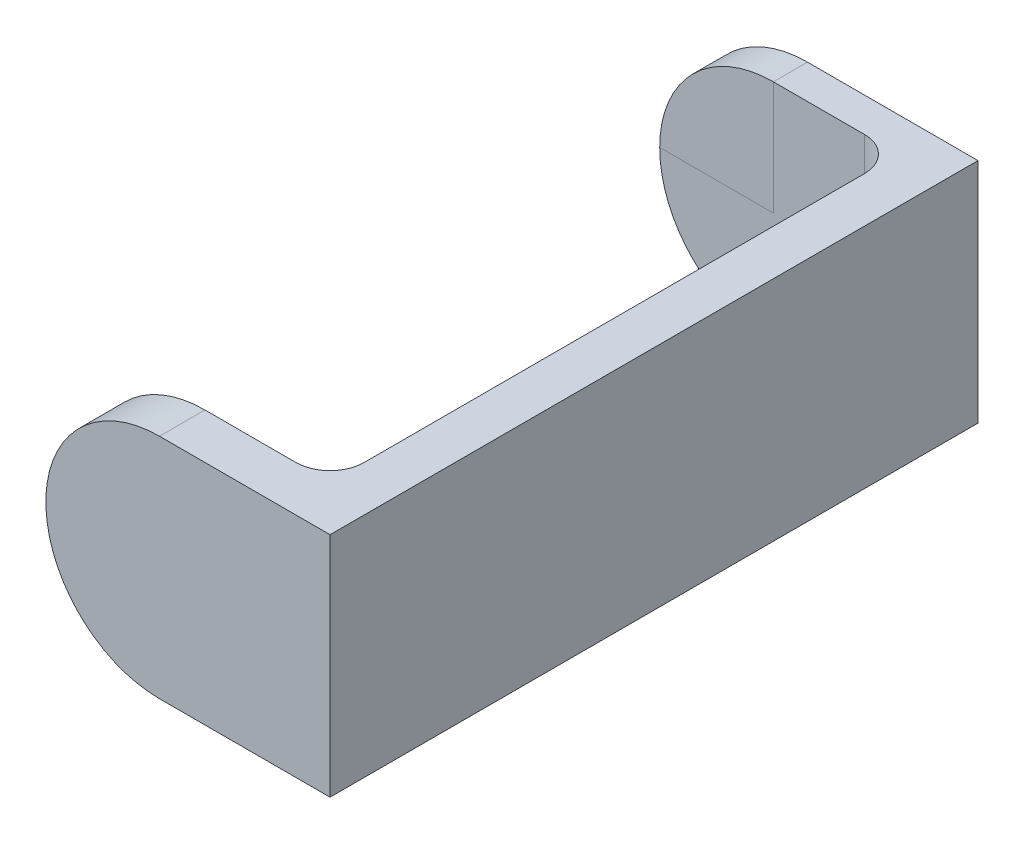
ISO-10303-21;
HEADER;
FILE_DESCRIPTION(('STEP AP214'),'2;1');
FILE_NAME('part.step','',(''),(''),'','','');
FILE_SCHEMA(('AUTOMOTIVE_DESIGN { 1 0 10303 214 1 1 1 1 }'));
ENDSEC;
DATA;
#1=APPLICATION_CONTEXT('core data for automotive mechanical design processes');
#2=APPLICATION_PROTOCOL_DEFINITION('international standard','automotive_design',2000,#1);
#3=PRODUCT_CONTEXT('',#1,'mechanical');
#4=PRODUCT('Part','Part','',(#3));
#5=PRODUCT_RELATED_PRODUCT_CATEGORY('part','',(#4));
#6=PRODUCT_DEFINITION_FORMATION('','',#4);
#7=PRODUCT_DEFINITION_CONTEXT('part definition',#1,'design');
#8=PRODUCT_DEFINITION('design','',#6,#7);
#9=PRODUCT_DEFINITION_SHAPE('','',#8);
#10=(LENGTH_UNIT() NAMED_UNIT(*) SI_UNIT(.MILLI.,.METRE.));
#11=(NAMED_UNIT(*) PLANE_ANGLE_UNIT() SI_UNIT($,.RADIAN.));
#12=(NAMED_UNIT(*) SI_UNIT($,.STERADIAN.) SOLID_ANGLE_UNIT());
#13=UNCERTAINTY_MEASURE_WITH_UNIT(LENGTH_MEASURE(1.E-05),#10,'distance_accuracy_value','');
#14=(GEOMETRIC_REPRESENTATION_CONTEXT(3) GLOBAL_UNCERTAINTY_ASSIGNED_CONTEXT((#13)) GLOBAL_UNIT_ASSIGNED_CONTEXT((#10,
#11,#12)) REPRESENTATION_CONTEXT('',''));
#15=CARTESIAN_POINT('',(0.,0.,0.));
#16=DIRECTION('',(0.,0.,1.));
#17=DIRECTION('',(1.,0.,0.));
#18=AXIS2_PLACEMENT_3D('',#15,#16,#17);
#19=CARTESIAN_POINT('',(0.,0.,500.));
#20=DIRECTION('',(0.,0.,1.));
#21=DIRECTION('',(1.,0.,0.));
#22=AXIS2_PLACEMENT_3D('',#19,#20,#21);
#23=PLANE('',#22);
#24=DIRECTION('',(-1.,0.,0.));
#25=VECTOR('',#24,1.);
#26=CARTESIAN_POINT('',(0.,200.,500.));
#27=LINE('',#26,#25);
#28=CARTESIAN_POINT('',(160.,200.,500.));
#29=VERTEX_POINT('',#28);
#30=CARTESIAN_POINT('',(0.,200.,500.));
#31=VERTEX_POINT('',#30);
#32=EDGE_CURVE('E171',#29,#31,#27,.T.);
#33=ORIENTED_EDGE('',*,*,#32,.F.);
#34=DIRECTION('',(0.,-1.,0.));
#35=VECTOR('',#34,1.);
#36=CARTESIAN_POINT('',(160.,-200.,500.));
#37=LINE('',#36,#35);
#38=CARTESIAN_POINT('',(160.,-200.,500.));
#39=VERTEX_POINT('',#38);
#40=EDGE_CURVE('E206',#29,#39,#37,.T.);
#41=ORIENTED_EDGE('',*,*,#40,.T.);
#42=DIRECTION('',(1.,0.,0.));
#43=VECTOR('',#42,1.);
#44=CARTESIAN_POINT('',(0.,-200.,500.));
#45=LINE('',#44,#43);
#46=CARTESIAN_POINT('',(0.,-200.,500.));
#47=VERTEX_POINT('',#46);
#48=EDGE_CURVE('E181',#47,#39,#45,.T.);
#49=ORIENTED_EDGE('',*,*,#48,.F.);
#50=CARTESIAN_POINT('',(0.,0.,500.));
#51=DIRECTION('',(0.,0.,1.));
#52=DIRECTION('',(1.,0.,0.));
#53=AXIS2_PLACEMENT_3D('',#50,#51,#52);
#54=CIRCLE('',#53,200.);
#55=CARTESIAN_POINT('',(-200.,0.,500.));
#56=VERTEX_POINT('',#55);
#57=EDGE_CURVE('E182',#56,#47,#54,.T.);
#58=ORIENTED_EDGE('',*,*,#57,.F.);
#59=DIRECTION('',(-1.,0.,0.));
#60=VECTOR('',#59,1.);
#61=CARTESIAN_POINT('',(0.,0.,500.));
#62=LINE('',#61,#60);
#63=CARTESIAN_POINT('',(0.,0.,500.));
#64=VERTEX_POINT('',#63);
#65=EDGE_CURVE('E232',#64,#56,#62,.T.);
#66=ORIENTED_EDGE('',*,*,#65,.F.);
#67=DIRECTION('',(0.,-1.,0.));
#68=VECTOR('',#67,1.);
#69=CARTESIAN_POINT('',(0.,0.,500.));
#70=LINE('',#69,#68);
#71=EDGE_CURVE('E227',#31,#64,#70,.T.);
#72=ORIENTED_EDGE('',*,*,#71,.F.);
#73=EDGE_LOOP('',(#33,#41,#49,#58,#66,#72));
#74=FACE_BOUND('',#73,.T.);
#75=ADVANCED_FACE('F38',(#74),#23,.F.);
#76=CARTESIAN_POINT('',(0.,0.,-500.));
#77=DIRECTION('',(0.,0.,1.));
#78=DIRECTION('',(1.,0.,0.));
#79=AXIS2_PLACEMENT_3D('',#76,#77,#78);
#80=PLANE('',#79);
#81=DIRECTION('',(1.,0.,0.));
#82=VECTOR('',#81,1.);
#83=CARTESIAN_POINT('',(0.,-200.,-500.));
#84=LINE('',#83,#82);
#85=CARTESIAN_POINT('',(0.,-200.,-500.));
#86=VERTEX_POINT('',#85);
#87=CARTESIAN_POINT('',(160.,-200.,-500.));
#88=VERTEX_POINT('',#87);
#89=EDGE_CURVE('E131',#86,#88,#84,.T.);
#90=ORIENTED_EDGE('',*,*,#89,.T.);
#91=DIRECTION('',(0.,-1.,0.));
#92=VECTOR('',#91,1.);
#93=CARTESIAN_POINT('',(160.,0.,-500.));
#94=LINE('',#93,#92);
#95=CARTESIAN_POINT('',(160.,200.,-500.));
#96=VERTEX_POINT('',#95);
#97=EDGE_CURVE('E59',#88,#96,#94,.F.);
#98=ORIENTED_EDGE('',*,*,#97,.T.);
#99=DIRECTION('',(-1.,0.,0.));
#100=VECTOR('',#99,1.);
#101=CARTESIAN_POINT('',(300.,200.,-500.));
#102=LINE('',#101,#100);
#103=CARTESIAN_POINT('',(0.,200.,-500.));
#104=VERTEX_POINT('',#103);
#105=EDGE_CURVE('E151',#96,#104,#102,.T.);
#106=ORIENTED_EDGE('',*,*,#105,.T.);
#107=DIRECTION('',(0.,-1.,0.));
#108=VECTOR('',#107,1.);
#109=CARTESIAN_POINT('',(0.,0.,-500.));
#110=LINE('',#109,#108);
#111=CARTESIAN_POINT('',(0.,0.,-500.));
#112=VERTEX_POINT('',#111);
#113=EDGE_CURVE('E236',#104,#112,#110,.T.);
#114=ORIENTED_EDGE('',*,*,#113,.T.);
#115=DIRECTION('',(-1.,0.,0.));
#116=VECTOR('',#115,1.);
#117=CARTESIAN_POINT('',(0.,0.,-500.));
#118=LINE('',#117,#116);
#119=CARTESIAN_POINT('',(-200.,0.,-500.));
#120=VERTEX_POINT('',#119);
#121=EDGE_CURVE('E239',#112,#120,#118,.T.);
#122=ORIENTED_EDGE('',*,*,#121,.T.);
#123=CARTESIAN_POINT('',(0.,0.,-500.));
#124=DIRECTION('',(0.,0.,1.));
#125=DIRECTION('',(1.,0.,0.));
#126=AXIS2_PLACEMENT_3D('',#123,#124,#125);
#127=CIRCLE('',#126,200.);
#128=EDGE_CURVE('E160',#120,#86,#127,.T.);
#129=ORIENTED_EDGE('',*,*,#128,.T.);
#130=EDGE_LOOP('',(#90,#98,#106,#114,#122,#129));
#131=FACE_BOUND('',#130,.T.);
#132=ADVANCED_FACE('F266',(#131),#80,.T.);
#133=CARTESIAN_POINT('',(0.,0.,580.));
#134=DIRECTION('',(0.,0.,-1.));
#135=DIRECTION('',(-1.,0.,0.));
#136=AXIS2_PLACEMENT_3D('',#133,#134,#135);
#137=CYLINDRICAL_SURFACE('',#136,200.);
#138=EDGE_CURVE('E178',#31,#56,#54,.T.);
#139=ORIENTED_EDGE('',*,*,#138,.T.);
#140=ORIENTED_EDGE('',*,*,#57,.T.);
#141=DIRECTION('',(0.,0.,-1.));
#142=VECTOR('',#141,1.);
#143=CARTESIAN_POINT('',(0.,-200.,580.));
#144=LINE('',#143,#142);
#145=CARTESIAN_POINT('',(0.,-200.,580.));
#146=VERTEX_POINT('',#145);
#147=EDGE_CURVE('E190',#146,#47,#144,.T.);
#148=ORIENTED_EDGE('',*,*,#147,.F.);
#149=CARTESIAN_POINT('',(0.,0.,580.));
#150=DIRECTION('',(0.,0.,1.));
#151=DIRECTION('',(1.,0.,0.));
#152=AXIS2_PLACEMENT_3D('',#149,#150,#151);
#153=CIRCLE('',#152,200.);
#154=CARTESIAN_POINT('',(0.,200.,580.));
#155=VERTEX_POINT('',#154);
#156=EDGE_CURVE('E167',#155,#146,#153,.T.);
#157=ORIENTED_EDGE('',*,*,#156,.F.);
#158=DIRECTION('',(0.,0.,-1.));
#159=VECTOR('',#158,1.);
#160=CARTESIAN_POINT('',(0.,200.,580.));
#161=LINE('',#160,#159);
#162=EDGE_CURVE('E177',#155,#31,#161,.T.);
#163=ORIENTED_EDGE('',*,*,#162,.T.);
#164=EDGE_LOOP('',(#139,#140,#148,#157,#163));
#165=FACE_BOUND('',#164,.T.);
#166=ADVANCED_FACE('F254',(#165),#137,.T.);
#167=CARTESIAN_POINT('',(0.,-200.,580.));
#168=DIRECTION('',(0.,1.,0.));
#169=DIRECTION('',(0.,0.,1.));
#170=AXIS2_PLACEMENT_3D('',#167,#168,#169);
#171=PLANE('',#170);
#172=ORIENTED_EDGE('',*,*,#48,.T.);
#173=CARTESIAN_POINT('',(160.,-200.,440.));
#174=DIRECTION('',(0.,1.,0.));
#175=DIRECTION('',(0.,0.,1.));
#176=AXIS2_PLACEMENT_3D('',#173,#174,#175);
#177=CIRCLE('',#176,60.);
#178=CARTESIAN_POINT('',(220.,-200.,440.000000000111));
#179=VERTEX_POINT('',#178);
#180=EDGE_CURVE('E209',#39,#179,#177,.T.);
#181=ORIENTED_EDGE('',*,*,#180,.T.);
#182=DIRECTION('',(0.,0.,-1.));
#183=VECTOR('',#182,1.);
#184=CARTESIAN_POINT('',(220.,-200.,500000.));
#185=LINE('',#184,#183);
#186=CARTESIAN_POINT('',(220.,-200.,-439.999999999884));
#187=VERTEX_POINT('',#186);
#188=EDGE_CURVE('E197',#179,#187,#185,.T.);
#189=ORIENTED_EDGE('',*,*,#188,.T.);
#190=CARTESIAN_POINT('',(160.,-200.,-439.999999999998));
#191=DIRECTION('',(0.,1.,0.));
#192=DIRECTION('',(0.,0.,1.));
#193=AXIS2_PLACEMENT_3D('',#190,#191,#192);
#194=CIRCLE('',#193,60.);
#195=EDGE_CURVE('E46',#187,#88,#194,.T.);
#196=ORIENTED_EDGE('',*,*,#195,.T.);
#197=ORIENTED_EDGE('',*,*,#89,.F.);
#198=DIRECTION('',(0.,0.,1.));
#199=VECTOR('',#198,1.);
#200=CARTESIAN_POINT('',(0.,-200.,-560.));
#201=LINE('',#200,#199);
#202=CARTESIAN_POINT('',(0.,-200.,-560.));
#203=VERTEX_POINT('',#202);
#204=EDGE_CURVE('E125',#203,#86,#201,.T.);
#205=ORIENTED_EDGE('',*,*,#204,.F.);
#206=DIRECTION('',(1.,0.,0.));
#207=VECTOR('',#206,1.);
#208=CARTESIAN_POINT('',(0.,-200.,-560.));
#209=LINE('',#208,#207);
#210=CARTESIAN_POINT('',(300.,-200.,-560.));
#211=VERTEX_POINT('',#210);
#212=EDGE_CURVE('E130',#203,#211,#209,.T.);
#213=ORIENTED_EDGE('',*,*,#212,.T.);
#214=DIRECTION('',(0.,0.,-1.));
#215=VECTOR('',#214,1.);
#216=CARTESIAN_POINT('',(300.,-200.,580.));
#217=LINE('',#216,#215);
#218=CARTESIAN_POINT('',(300.,-200.,580.));
#219=VERTEX_POINT('',#218);
#220=EDGE_CURVE('E245',#219,#211,#217,.T.);
#221=ORIENTED_EDGE('',*,*,#220,.F.);
#222=DIRECTION('',(1.,0.,0.));
#223=VECTOR('',#222,1.);
#224=CARTESIAN_POINT('',(0.,-200.,580.));
#225=LINE('',#224,#223);
#226=EDGE_CURVE('E170',#146,#219,#225,.T.);
#227=ORIENTED_EDGE('',*,*,#226,.F.);
#228=ORIENTED_EDGE('',*,*,#147,.T.);
#229=EDGE_LOOP('',(#172,#181,#189,#196,#197,#205,#213,#221,#227,#228));
#230=FACE_BOUND('',#229,.T.);
#231=ADVANCED_FACE('F128',(#230),#171,.F.);
#232=CARTESIAN_POINT('',(300.,-200.,580.));
#233=DIRECTION('',(-1.,0.,0.));
#234=DIRECTION('',(0.,0.,1.));
#235=AXIS2_PLACEMENT_3D('',#232,#233,#234);
#236=PLANE('',#235);
#237=ORIENTED_EDGE('',*,*,#220,.T.);
#238=DIRECTION('',(0.,1.,0.));
#239=VECTOR('',#238,1.);
#240=CARTESIAN_POINT('',(300.,-200.,-560.));
#241=LINE('',#240,#239);
#242=CARTESIAN_POINT('',(300.,200.,-560.));
#243=VERTEX_POINT('',#242);
#244=EDGE_CURVE('E146',#211,#243,#241,.T.);
#245=ORIENTED_EDGE('',*,*,#244,.T.);
#246=DIRECTION('',(0.,0.,-1.));
#247=VECTOR('',#246,1.);
#248=CARTESIAN_POINT('',(300.,200.,580.));
#249=LINE('',#248,#247);
#250=CARTESIAN_POINT('',(300.,200.,580.));
#251=VERTEX_POINT('',#250);
#252=EDGE_CURVE('E247',#251,#243,#249,.T.);
#253=ORIENTED_EDGE('',*,*,#252,.F.);
#254=DIRECTION('',(0.,1.,0.));
#255=VECTOR('',#254,1.);
#256=CARTESIAN_POINT('',(300.,-200.,580.));
#257=LINE('',#256,#255);
#258=EDGE_CURVE('E173',#219,#251,#257,.T.);
#259=ORIENTED_EDGE('',*,*,#258,.F.);
#260=EDGE_LOOP('',(#237,#245,#253,#259));
#261=FACE_BOUND('',#260,.T.);
#262=ADVANCED_FACE('F294',(#261),#236,.F.);
#263=CARTESIAN_POINT('',(0.,200.,580.));
#264=DIRECTION('',(0.,-1.,0.));
#265=DIRECTION('',(0.,0.,-1.));
#266=AXIS2_PLACEMENT_3D('',#263,#264,#265);
#267=PLANE('',#266);
#268=ORIENTED_EDGE('',*,*,#252,.T.);
#269=DIRECTION('',(-1.,0.,0.));
#270=VECTOR('',#269,1.);
#271=CARTESIAN_POINT('',(300.,200.,-560.));
#272=LINE('',#271,#270);
#273=CARTESIAN_POINT('',(0.,200.,-560.));
#274=VERTEX_POINT('',#273);
#275=EDGE_CURVE('E136',#243,#274,#272,.T.);
#276=ORIENTED_EDGE('',*,*,#275,.T.);
#277=DIRECTION('',(0.,0.,1.));
#278=VECTOR('',#277,1.);
#279=CARTESIAN_POINT('',(0.,200.,-560.));
#280=LINE('',#279,#278);
#281=EDGE_CURVE('E135',#274,#104,#280,.T.);
#282=ORIENTED_EDGE('',*,*,#281,.T.);
#283=ORIENTED_EDGE('',*,*,#105,.F.);
#284=CARTESIAN_POINT('',(160.,200.,-439.999999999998));
#285=DIRECTION('',(0.,-1.,0.));
#286=DIRECTION('',(0.,0.,-1.));
#287=AXIS2_PLACEMENT_3D('',#284,#285,#286);
#288=CIRCLE('',#287,60.);
#289=CARTESIAN_POINT('',(220.,200.,-439.999999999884));
#290=VERTEX_POINT('',#289);
#291=EDGE_CURVE('E11',#96,#290,#288,.T.);
#292=ORIENTED_EDGE('',*,*,#291,.T.);
#293=DIRECTION('',(0.,0.,-1.));
#294=VECTOR('',#293,1.);
#295=CARTESIAN_POINT('',(220.,200.,500000.));
#296=LINE('',#295,#294);
#297=CARTESIAN_POINT('',(220.,200.,440.000000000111));
#298=VERTEX_POINT('',#297);
#299=EDGE_CURVE('E200',#298,#290,#296,.T.);
#300=ORIENTED_EDGE('',*,*,#299,.F.);
#301=CARTESIAN_POINT('',(160.,200.,440.));
#302=DIRECTION('',(0.,-1.,0.));
#303=DIRECTION('',(0.,0.,-1.));
#304=AXIS2_PLACEMENT_3D('',#301,#302,#303);
#305=CIRCLE('',#304,60.);
#306=EDGE_CURVE('E211',#298,#29,#305,.T.);
#307=ORIENTED_EDGE('',*,*,#306,.T.);
#308=ORIENTED_EDGE('',*,*,#32,.T.);
#309=ORIENTED_EDGE('',*,*,#162,.F.);
#310=DIRECTION('',(-1.,0.,0.));
#311=VECTOR('',#310,1.);
#312=CARTESIAN_POINT('',(0.,200.,580.));
#313=LINE('',#312,#311);
#314=EDGE_CURVE('E175',#251,#155,#313,.T.);
#315=ORIENTED_EDGE('',*,*,#314,.F.);
#316=EDGE_LOOP('',(#268,#276,#282,#283,#292,#300,#307,#308,#309,#315));
#317=FACE_BOUND('',#316,.T.);
#318=ADVANCED_FACE('F216',(#317),#267,.F.);
#319=CARTESIAN_POINT('',(0.,0.,580.));
#320=DIRECTION('',(0.,0.,1.));
#321=DIRECTION('',(1.,0.,0.));
#322=AXIS2_PLACEMENT_3D('',#319,#320,#321);
#323=PLANE('',#322);
#324=ORIENTED_EDGE('',*,*,#156,.T.);
#325=ORIENTED_EDGE('',*,*,#226,.T.);
#326=ORIENTED_EDGE('',*,*,#258,.T.);
#327=ORIENTED_EDGE('',*,*,#314,.T.);
#328=EDGE_LOOP('',(#324,#325,#326,#327));
#329=FACE_BOUND('',#328,.T.);
#330=ADVANCED_FACE('F286',(#329),#323,.T.);
#331=ORIENTED_EDGE('',*,*,#138,.F.);
#332=ORIENTED_EDGE('',*,*,#71,.T.);
#333=ORIENTED_EDGE('',*,*,#65,.T.);
#334=EDGE_LOOP('',(#331,#332,#333));
#335=FACE_BOUND('',#334,.T.);
#336=ADVANCED_FACE('F257',(#335),#23,.F.);
#337=CARTESIAN_POINT('',(220.,-200.,500000.));
#338=DIRECTION('',(1.,0.,0.));
#339=DIRECTION('',(0.,0.,-1.));
#340=AXIS2_PLACEMENT_3D('',#337,#338,#339);
#341=PLANE('',#340);
#342=ORIENTED_EDGE('',*,*,#188,.F.);
#343=DIRECTION('',(0.,-1.,0.));
#344=VECTOR('',#343,1.);
#345=CARTESIAN_POINT('',(220.,200.,440.));
#346=LINE('',#345,#344);
#347=EDGE_CURVE('E205',#179,#298,#346,.F.);
#348=ORIENTED_EDGE('',*,*,#347,.T.);
#349=ORIENTED_EDGE('',*,*,#299,.T.);
#350=DIRECTION('',(0.,-1.,0.));
#351=VECTOR('',#350,1.);
#352=CARTESIAN_POINT('',(220.,-200.,-439.999999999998));
#353=LINE('',#352,#351);
#354=EDGE_CURVE('E202',#290,#187,#353,.T.);
#355=ORIENTED_EDGE('',*,*,#354,.T.);
#356=EDGE_LOOP('',(#342,#348,#349,#355));
#357=FACE_BOUND('',#356,.T.);
#358=ADVANCED_FACE('F262',(#357),#341,.F.);
#359=ORIENTED_EDGE('',*,*,#113,.F.);
#360=EDGE_CURVE('E157',#104,#120,#127,.T.);
#361=ORIENTED_EDGE('',*,*,#360,.T.);
#362=ORIENTED_EDGE('',*,*,#121,.F.);
#363=EDGE_LOOP('',(#359,#361,#362));
#364=FACE_BOUND('',#363,.T.);
#365=ADVANCED_FACE('F268',(#364),#80,.T.);
#366=CARTESIAN_POINT('',(0.,0.,-560.));
#367=DIRECTION('',(0.,0.,1.));
#368=DIRECTION('',(1.,0.,0.));
#369=AXIS2_PLACEMENT_3D('',#366,#367,#368);
#370=CYLINDRICAL_SURFACE('',#369,200.);
#371=ORIENTED_EDGE('',*,*,#360,.F.);
#372=ORIENTED_EDGE('',*,*,#281,.F.);
#373=CARTESIAN_POINT('',(0.,0.,-560.));
#374=DIRECTION('',(0.,0.,1.));
#375=DIRECTION('',(1.,0.,0.));
#376=AXIS2_PLACEMENT_3D('',#373,#374,#375);
#377=CIRCLE('',#376,200.);
#378=EDGE_CURVE('E143',#274,#203,#377,.T.);
#379=ORIENTED_EDGE('',*,*,#378,.T.);
#380=ORIENTED_EDGE('',*,*,#204,.T.);
#381=ORIENTED_EDGE('',*,*,#128,.F.);
#382=EDGE_LOOP('',(#371,#372,#379,#380,#381));
#383=FACE_BOUND('',#382,.T.);
#384=ADVANCED_FACE('F149',(#383),#370,.T.);
#385=CARTESIAN_POINT('',(0.,0.,-560.));
#386=DIRECTION('',(0.,0.,1.));
#387=DIRECTION('',(1.,0.,0.));
#388=AXIS2_PLACEMENT_3D('',#385,#386,#387);
#389=PLANE('',#388);
#390=ORIENTED_EDGE('',*,*,#378,.F.);
#391=ORIENTED_EDGE('',*,*,#275,.F.);
#392=ORIENTED_EDGE('',*,*,#244,.F.);
#393=ORIENTED_EDGE('',*,*,#212,.F.);
#394=EDGE_LOOP('',(#390,#391,#392,#393));
#395=FACE_BOUND('',#394,.T.);
#396=ADVANCED_FACE('F141',(#395),#389,.F.);
#397=CARTESIAN_POINT('',(160.,0.,440.));
#398=DIRECTION('',(0.,1.,0.));
#399=DIRECTION('',(0.,0.,1.));
#400=AXIS2_PLACEMENT_3D('',#397,#398,#399);
#401=CYLINDRICAL_SURFACE('',#400,60.);
#402=ORIENTED_EDGE('',*,*,#306,.F.);
#403=ORIENTED_EDGE('',*,*,#347,.F.);
#404=ORIENTED_EDGE('',*,*,#180,.F.);
#405=ORIENTED_EDGE('',*,*,#40,.F.);
#406=EDGE_LOOP('',(#402,#403,#404,#405));
#407=FACE_BOUND('',#406,.T.);
#408=ADVANCED_FACE('F230',(#407),#401,.F.);
#409=CARTESIAN_POINT('',(160.,-200.,-439.999999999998));
#410=DIRECTION('',(0.,-1.,0.));
#411=DIRECTION('',(0.,0.,-1.));
#412=AXIS2_PLACEMENT_3D('',#409,#410,#411);
#413=CYLINDRICAL_SURFACE('',#412,60.);
#414=ORIENTED_EDGE('',*,*,#291,.F.);
#415=ORIENTED_EDGE('',*,*,#97,.F.);
#416=ORIENTED_EDGE('',*,*,#195,.F.);
#417=ORIENTED_EDGE('',*,*,#354,.F.);
#418=EDGE_LOOP('',(#414,#415,#416,#417));
#419=FACE_BOUND('',#418,.T.);
#420=ADVANCED_FACE('F40',(#419),#413,.F.);
#421=CLOSED_SHELL('',(#75,#132,#166,#231,#262,#318,#330,#336,#358,#365,#384,#396,#408,#420));
#422=MANIFOLD_SOLID_BREP('B2',#421);
#423=ADVANCED_BREP_SHAPE_REPRESENTATION('',(#18,#422),#14);
#424=SHAPE_DEFINITION_REPRESENTATION(#9,#423);
ENDSEC;
END-ISO-10303-21;
